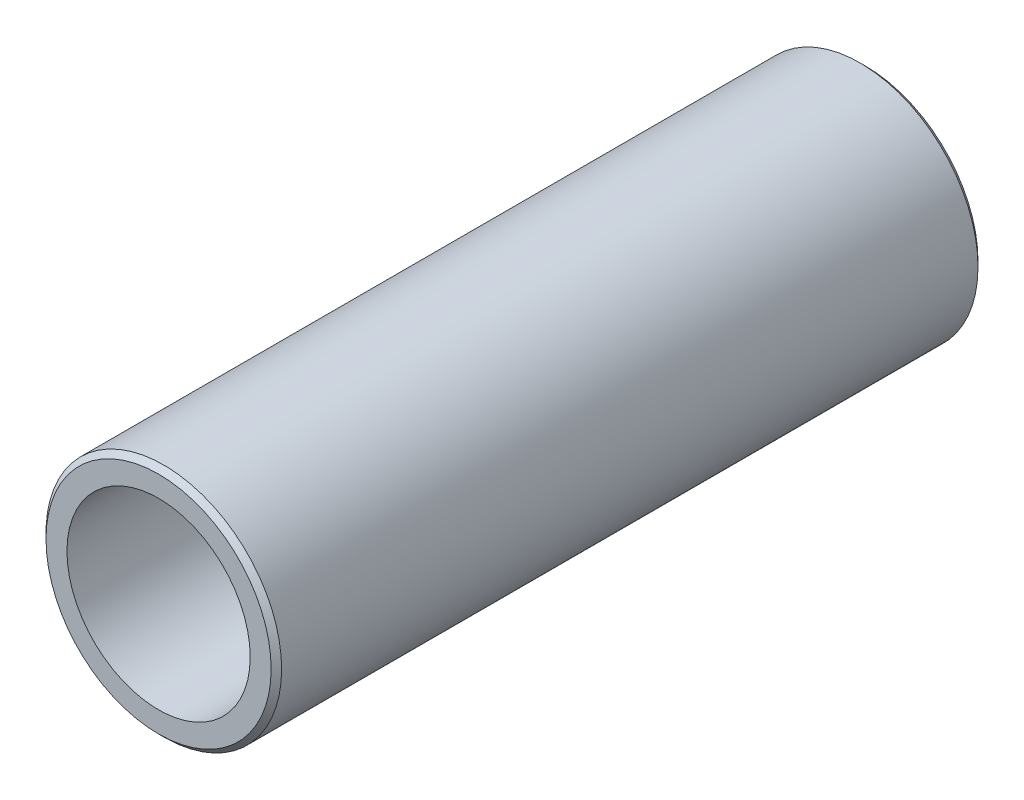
from build123d import *

# Parameters (mm, degrees)
ESQUISSE1_R        = 4.5
ESQUISSE1_R_2      = 3.5
BOSS_EXTRU_1_DEPTH = 27
CHANFREIN1_SIZE    = 0.2


with BuildPart() as part:
    # Esquisse1 → Boss.-Extru.1 (new body)
    with BuildSketch(Plane.XY):
        with Locations((-20.5, 0)):
            Circle(ESQUISSE1_R)
        with Locations((-20.5, 0)):
            Circle(ESQUISSE1_R_2, mode=Mode.SUBTRACT)
    extrude(amount=-BOSS_EXTRU_1_DEPTH)

    # Chanfrein1
    chanfrein1_edges = [part.edges().sort_by_distance(p)[0] for p in [
        (-25, 0, 0),
        (-25, 0, -27),
    ]]
    chamfer(chanfrein1_edges, length=CHANFREIN1_SIZE)


solid = part.part
